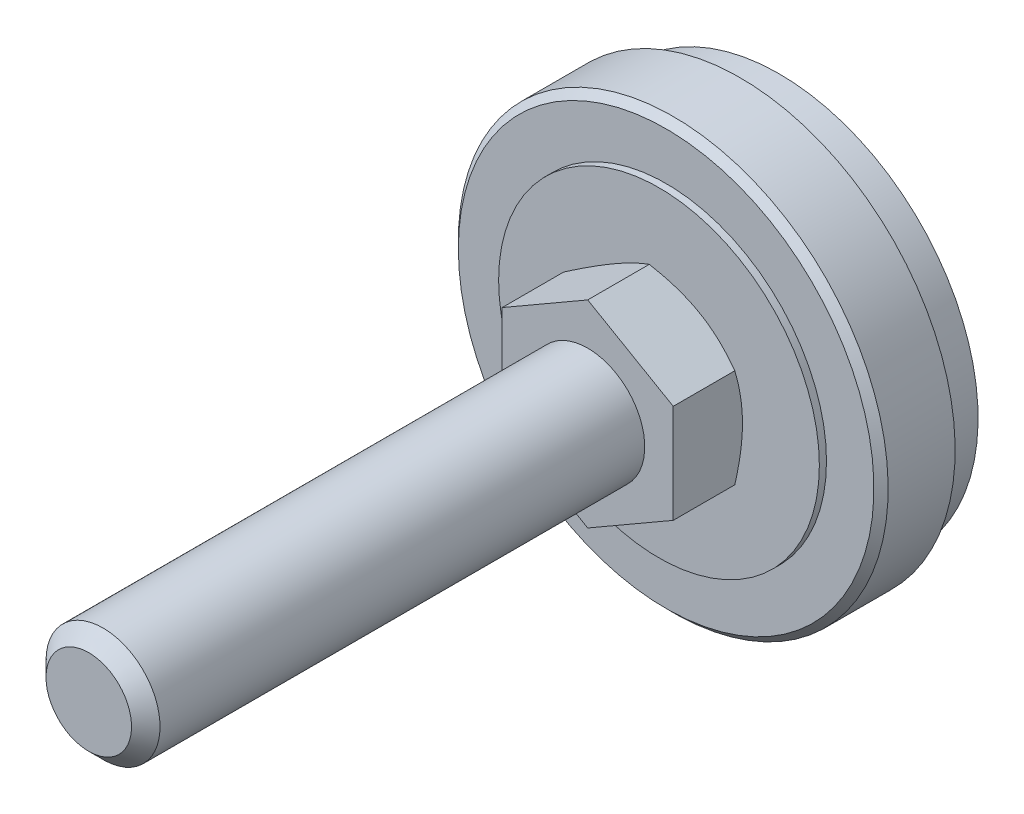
ISO-10303-21;
HEADER;
FILE_DESCRIPTION(('STEP AP214'),'2;1');
FILE_NAME('part.step','',(''),(''),'','','');
FILE_SCHEMA(('AUTOMOTIVE_DESIGN { 1 0 10303 214 1 1 1 1 }'));
ENDSEC;
DATA;
#1=APPLICATION_CONTEXT('core data for automotive mechanical design processes');
#2=APPLICATION_PROTOCOL_DEFINITION('international standard','automotive_design',2000,#1);
#3=PRODUCT_CONTEXT('',#1,'mechanical');
#4=PRODUCT('Part','Part','',(#3));
#5=PRODUCT_RELATED_PRODUCT_CATEGORY('part','',(#4));
#6=PRODUCT_DEFINITION_FORMATION('','',#4);
#7=PRODUCT_DEFINITION_CONTEXT('part definition',#1,'design');
#8=PRODUCT_DEFINITION('design','',#6,#7);
#9=PRODUCT_DEFINITION_SHAPE('','',#8);
#10=(LENGTH_UNIT() NAMED_UNIT(*) SI_UNIT(.MILLI.,.METRE.));
#11=(NAMED_UNIT(*) PLANE_ANGLE_UNIT() SI_UNIT($,.RADIAN.));
#12=(NAMED_UNIT(*) SI_UNIT($,.STERADIAN.) SOLID_ANGLE_UNIT());
#13=UNCERTAINTY_MEASURE_WITH_UNIT(LENGTH_MEASURE(1.E-05),#10,'distance_accuracy_value','');
#14=(GEOMETRIC_REPRESENTATION_CONTEXT(3) GLOBAL_UNCERTAINTY_ASSIGNED_CONTEXT((#13)) GLOBAL_UNIT_ASSIGNED_CONTEXT((#10,
#11,#12)) REPRESENTATION_CONTEXT('',''));
#15=CARTESIAN_POINT('',(0.,0.,0.));
#16=DIRECTION('',(0.,0.,1.));
#17=DIRECTION('',(1.,0.,0.));
#18=AXIS2_PLACEMENT_3D('',#15,#16,#17);
#19=CARTESIAN_POINT('',(0.,0.,26.8670162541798));
#20=DIRECTION('',(0.,0.,1.));
#21=DIRECTION('',(0.5,-0.866025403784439,0.));
#22=AXIS2_PLACEMENT_3D('',#19,#20,#21);
#23=PLANE('',#22);
#24=DIRECTION('',(0.,1.,0.));
#25=VECTOR('',#24,1.);
#26=CARTESIAN_POINT('',(12.,-6.9282032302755,26.8670162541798));
#27=LINE('',#26,#25);
#28=CARTESIAN_POINT('',(12.,-6.9282032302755,26.8670162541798));
#29=VERTEX_POINT('',#28);
#30=CARTESIAN_POINT('',(12.,6.9282032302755,26.8670162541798));
#31=VERTEX_POINT('',#30);
#32=EDGE_CURVE('E227',#29,#31,#27,.T.);
#33=ORIENTED_EDGE('',*,*,#32,.T.);
#34=DIRECTION('',(-0.866025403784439,0.5,0.));
#35=VECTOR('',#34,1.);
#36=CARTESIAN_POINT('',(12.,6.9282032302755,26.8670162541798));
#37=LINE('',#36,#35);
#38=CARTESIAN_POINT('',(0.,13.856406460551,26.8670162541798));
#39=VERTEX_POINT('',#38);
#40=EDGE_CURVE('E374',#31,#39,#37,.T.);
#41=ORIENTED_EDGE('',*,*,#40,.T.);
#42=DIRECTION('',(-0.866025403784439,-0.5,0.));
#43=VECTOR('',#42,1.);
#44=CARTESIAN_POINT('',(0.,13.856406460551,26.8670162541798));
#45=LINE('',#44,#43);
#46=CARTESIAN_POINT('',(-12.,6.92820323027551,26.8670162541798));
#47=VERTEX_POINT('',#46);
#48=EDGE_CURVE('E373',#39,#47,#45,.T.);
#49=ORIENTED_EDGE('',*,*,#48,.T.);
#50=DIRECTION('',(0.,-1.,0.));
#51=VECTOR('',#50,1.);
#52=CARTESIAN_POINT('',(-12.,6.92820323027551,26.8670162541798));
#53=LINE('',#52,#51);
#54=CARTESIAN_POINT('',(-12.,-6.9282032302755,26.8670162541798));
#55=VERTEX_POINT('',#54);
#56=EDGE_CURVE('E378',#47,#55,#53,.T.);
#57=ORIENTED_EDGE('',*,*,#56,.T.);
#58=DIRECTION('',(0.866025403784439,-0.5,0.));
#59=VECTOR('',#58,1.);
#60=CARTESIAN_POINT('',(-12.,-6.9282032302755,26.8670162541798));
#61=LINE('',#60,#59);
#62=CARTESIAN_POINT('',(0.,-13.856406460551,26.8670162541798));
#63=VERTEX_POINT('',#62);
#64=EDGE_CURVE('E380',#55,#63,#61,.T.);
#65=ORIENTED_EDGE('',*,*,#64,.T.);
#66=DIRECTION('',(0.866025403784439,0.5,0.));
#67=VECTOR('',#66,1.);
#68=CARTESIAN_POINT('',(0.,-13.856406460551,26.8670162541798));
#69=LINE('',#68,#67);
#70=EDGE_CURVE('E37',#63,#29,#69,.T.);
#71=ORIENTED_EDGE('',*,*,#70,.T.);
#72=EDGE_LOOP('',(#33,#41,#49,#57,#65,#71));
#73=FACE_BOUND('',#72,.T.);
#74=CARTESIAN_POINT('',(0.,0.,26.8670162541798));
#75=DIRECTION('',(0.,0.,1.));
#76=DIRECTION('',(0.5,-0.866025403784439,0.));
#77=AXIS2_PLACEMENT_3D('',#74,#75,#76);
#78=CIRCLE('',#77,8.);
#79=CARTESIAN_POINT('',(4.,-6.92820323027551,26.8670162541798));
#80=VERTEX_POINT('',#79);
#81=EDGE_CURVE('E231',#80,#80,#78,.T.);
#82=ORIENTED_EDGE('',*,*,#81,.F.);
#83=EDGE_LOOP('',(#82));
#84=FACE_BOUND('',#83,.T.);
#85=ADVANCED_FACE('F14',(#73,#84),#23,.T.);
#86=CARTESIAN_POINT('',(-11.2500000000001,19.4855715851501,16.8670162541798));
#87=DIRECTION('',(0.,0.,-1.));
#88=DIRECTION('',(-0.5,0.866025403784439,0.));
#89=AXIS2_PLACEMENT_3D('',#86,#87,#88);
#90=PLANE('',#89);
#91=CARTESIAN_POINT('',(0.,0.,16.8670162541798));
#92=DIRECTION('',(0.,0.,1.));
#93=DIRECTION('',(0.5,-0.866025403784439,0.));
#94=AXIS2_PLACEMENT_3D('',#91,#92,#93);
#95=CIRCLE('',#94,22.5000000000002);
#96=CARTESIAN_POINT('',(11.2500000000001,-19.4855715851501,16.8670162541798));
#97=VERTEX_POINT('',#96);
#98=EDGE_CURVE('E105',#97,#97,#95,.T.);
#99=ORIENTED_EDGE('',*,*,#98,.T.);
#100=EDGE_LOOP('',(#99));
#101=FACE_BOUND('',#100,.T.);
#102=CARTESIAN_POINT('',(0.,0.,16.8670162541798));
#103=DIRECTION('',(0.,0.,-1.));
#104=DIRECTION('',(-0.5,0.866025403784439,0.));
#105=AXIS2_PLACEMENT_3D('',#102,#103,#104);
#106=CIRCLE('',#105,11.5);
#107=CARTESIAN_POINT('',(-5.75,9.95929214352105,16.8670162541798));
#108=VERTEX_POINT('',#107);
#109=EDGE_CURVE('E84',#108,#108,#106,.T.);
#110=ORIENTED_EDGE('',*,*,#109,.T.);
#111=EDGE_LOOP('',(#110));
#112=FACE_BOUND('',#111,.T.);
#113=ADVANCED_FACE('F190',(#101,#112),#90,.F.);
#114=CARTESIAN_POINT('',(-14.575,25.2446405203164,15.8670162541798));
#115=DIRECTION('',(0.,0.,-1.));
#116=DIRECTION('',(-0.5,0.866025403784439,0.));
#117=AXIS2_PLACEMENT_3D('',#114,#115,#116);
#118=PLANE('',#117);
#119=CARTESIAN_POINT('',(0.,0.,15.8670162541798));
#120=DIRECTION('',(0.,0.,1.));
#121=DIRECTION('',(0.5,-0.866025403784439,0.));
#122=AXIS2_PLACEMENT_3D('',#119,#120,#121);
#123=CIRCLE('',#122,22.5000000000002);
#124=CARTESIAN_POINT('',(11.2500000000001,-19.4855715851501,15.8670162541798));
#125=VERTEX_POINT('',#124);
#126=EDGE_CURVE('E102',#125,#125,#123,.T.);
#127=ORIENTED_EDGE('',*,*,#126,.F.);
#128=EDGE_LOOP('',(#127));
#129=FACE_BOUND('',#128,.T.);
#130=CARTESIAN_POINT('',(0.,0.,15.8670162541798));
#131=DIRECTION('',(0.,0.,1.));
#132=DIRECTION('',(0.5,-0.866025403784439,0.));
#133=AXIS2_PLACEMENT_3D('',#130,#131,#132);
#134=CIRCLE('',#133,29.15);
#135=CARTESIAN_POINT('',(14.575,-25.2446405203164,15.8670162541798));
#136=VERTEX_POINT('',#135);
#137=EDGE_CURVE('E73',#136,#136,#134,.T.);
#138=ORIENTED_EDGE('',*,*,#137,.T.);
#139=EDGE_LOOP('',(#138));
#140=FACE_BOUND('',#139,.T.);
#141=ADVANCED_FACE('F193',(#129,#140),#118,.F.);
#142=CARTESIAN_POINT('',(0.,0.,14.8670162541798));
#143=DIRECTION('',(0.,0.,-1.));
#144=DIRECTION('',(-0.5,0.866025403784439,0.));
#145=AXIS2_PLACEMENT_3D('',#142,#143,#144);
#146=CONICAL_SURFACE('',#145,30.15,0.785398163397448);
#147=ORIENTED_EDGE('',*,*,#137,.F.);
#148=EDGE_LOOP('',(#147));
#149=FACE_BOUND('',#148,.T.);
#150=CARTESIAN_POINT('',(0.,0.,14.8670162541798));
#151=DIRECTION('',(0.,0.,1.));
#152=DIRECTION('',(0.5,-0.866025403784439,0.));
#153=AXIS2_PLACEMENT_3D('',#150,#151,#152);
#154=CIRCLE('',#153,30.15);
#155=CARTESIAN_POINT('',(15.075,-26.1106659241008,14.8670162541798));
#156=VERTEX_POINT('',#155);
#157=EDGE_CURVE('E117',#156,#156,#154,.T.);
#158=ORIENTED_EDGE('',*,*,#157,.T.);
#159=EDGE_LOOP('',(#158));
#160=FACE_BOUND('',#159,.T.);
#161=ADVANCED_FACE('F209',(#149,#160),#146,.T.);
#162=CARTESIAN_POINT('',(0.,0.,104.609314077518));
#163=DIRECTION('',(0.,0.,1.));
#164=DIRECTION('',(0.5,-0.866025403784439,0.));
#165=AXIS2_PLACEMENT_3D('',#162,#163,#164);
#166=CYLINDRICAL_SURFACE('',#165,30.15);
#167=ORIENTED_EDGE('',*,*,#157,.F.);
#168=EDGE_LOOP('',(#167));
#169=FACE_BOUND('',#168,.T.);
#170=CARTESIAN_POINT('',(0.,0.,5.46701625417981));
#171=DIRECTION('',(0.,0.,1.));
#172=DIRECTION('',(0.5,-0.866025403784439,0.));
#173=AXIS2_PLACEMENT_3D('',#170,#171,#172);
#174=CIRCLE('',#173,30.15);
#175=CARTESIAN_POINT('',(15.075,-26.1106659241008,5.46701625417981));
#176=VERTEX_POINT('',#175);
#177=EDGE_CURVE('E114',#176,#176,#174,.T.);
#178=ORIENTED_EDGE('',*,*,#177,.T.);
#179=EDGE_LOOP('',(#178));
#180=FACE_BOUND('',#179,.T.);
#181=ADVANCED_FACE('F205',(#169,#180),#166,.T.);
#182=CARTESIAN_POINT('',(-15.075,26.1106659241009,5.46701625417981));
#183=DIRECTION('',(0.,0.,1.));
#184=DIRECTION('',(0.5,-0.866025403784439,0.));
#185=AXIS2_PLACEMENT_3D('',#182,#183,#184);
#186=PLANE('',#185);
#187=ORIENTED_EDGE('',*,*,#177,.F.);
#188=EDGE_LOOP('',(#187));
#189=FACE_BOUND('',#188,.T.);
#190=CARTESIAN_POINT('',(0.,0.,5.46701625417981));
#191=DIRECTION('',(0.,0.,1.));
#192=DIRECTION('',(0.5,-0.866025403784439,0.));
#193=AXIS2_PLACEMENT_3D('',#190,#191,#192);
#194=CIRCLE('',#193,27.9);
#195=CARTESIAN_POINT('',(13.95,-24.1621087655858,5.46701625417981));
#196=VERTEX_POINT('',#195);
#197=EDGE_CURVE('E111',#196,#196,#194,.T.);
#198=ORIENTED_EDGE('',*,*,#197,.T.);
#199=EDGE_LOOP('',(#198));
#200=FACE_BOUND('',#199,.T.);
#201=ADVANCED_FACE('F201',(#189,#200),#186,.F.);
#202=CARTESIAN_POINT('',(0.,0.,104.609314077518));
#203=DIRECTION('',(0.,0.,1.));
#204=DIRECTION('',(0.5,-0.866025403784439,0.));
#205=AXIS2_PLACEMENT_3D('',#202,#203,#204);
#206=CYLINDRICAL_SURFACE('',#205,27.9);
#207=ORIENTED_EDGE('',*,*,#197,.F.);
#208=EDGE_LOOP('',(#207));
#209=FACE_BOUND('',#208,.T.);
#210=CARTESIAN_POINT('',(0.,0.,0.));
#211=DIRECTION('',(0.,0.,1.));
#212=DIRECTION('',(0.5,-0.866025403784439,0.));
#213=AXIS2_PLACEMENT_3D('',#210,#211,#212);
#214=CIRCLE('',#213,27.9);
#215=CARTESIAN_POINT('',(13.95,-24.1621087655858,0.));
#216=VERTEX_POINT('',#215);
#217=EDGE_CURVE('E108',#216,#216,#214,.T.);
#218=ORIENTED_EDGE('',*,*,#217,.T.);
#219=EDGE_LOOP('',(#218));
#220=FACE_BOUND('',#219,.T.);
#221=ADVANCED_FACE('F197',(#209,#220),#206,.T.);
#222=CARTESIAN_POINT('',(-13.95,24.1621087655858,0.));
#223=DIRECTION('',(0.,0.,1.));
#224=DIRECTION('',(0.5,-0.866025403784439,0.));
#225=AXIS2_PLACEMENT_3D('',#222,#223,#224);
#226=PLANE('',#225);
#227=ORIENTED_EDGE('',*,*,#217,.F.);
#228=EDGE_LOOP('',(#227));
#229=FACE_BOUND('',#228,.T.);
#230=ADVANCED_FACE('F188',(#229),#226,.F.);
#231=CARTESIAN_POINT('',(0.,0.,104.609314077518));
#232=DIRECTION('',(0.,0.,1.));
#233=DIRECTION('',(0.5,-0.866025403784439,0.));
#234=AXIS2_PLACEMENT_3D('',#231,#232,#233);
#235=CYLINDRICAL_SURFACE('',#234,22.5000000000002);
#236=ORIENTED_EDGE('',*,*,#98,.F.);
#237=EDGE_LOOP('',(#236));
#238=FACE_BOUND('',#237,.T.);
#239=ORIENTED_EDGE('',*,*,#126,.T.);
#240=EDGE_LOOP('',(#239));
#241=FACE_BOUND('',#240,.T.);
#242=ADVANCED_FACE('F133',(#238,#241),#235,.T.);
#243=CARTESIAN_POINT('',(0.,0.,20.9823079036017));
#244=DIRECTION('',(0.,0.,1.));
#245=DIRECTION('',(0.5,-0.866025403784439,0.));
#246=AXIS2_PLACEMENT_3D('',#243,#244,#245);
#247=CONICAL_SURFACE('',#246,18.6278942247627,1.0471975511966);
#248=ORIENTED_EDGE('',*,*,#109,.F.);
#249=EDGE_LOOP('',(#248));
#250=FACE_BOUND('',#249,.T.);
#251=CARTESIAN_POINT('',(-10.2110298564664,-19.7517472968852,23.0648899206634));
#252=CARTESIAN_POINT('',(-9.98368629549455,-19.6204904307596,22.9372974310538));
#253=CARTESIAN_POINT('',(-9.75607849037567,-19.4890810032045,22.8103330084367));
#254=CARTESIAN_POINT('',(-9.30027928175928,-19.2259252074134,22.5578023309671));
#255=CARTESIAN_POINT('',(-9.0720878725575,-19.094178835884,22.4322360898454));
#256=CARTESIAN_POINT('',(-8.38649609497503,-18.6983522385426,22.0578152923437));
#257=CARTESIAN_POINT('',(-7.92814398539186,-18.4337225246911,21.8112756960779));
#258=CARTESIAN_POINT('',(-7.00595438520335,-17.9012961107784,21.3245359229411));
#259=CARTESIAN_POINT('',(-6.54210067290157,-17.6334900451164,21.0843766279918));
#260=CARTESIAN_POINT('',(-5.61073723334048,-17.0957671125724,20.613737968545));
#261=CARTESIAN_POINT('',(-5.14322767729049,-16.8258503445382,20.3832581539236));
#262=CARTESIAN_POINT('',(-4.18836683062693,-16.2745611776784,19.9271602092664));
#263=CARTESIAN_POINT('',(-3.70086837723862,-15.9931038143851,19.7019507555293));
#264=CARTESIAN_POINT('',(-2.72019960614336,-15.4269144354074,19.2683134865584));
#265=CARTESIAN_POINT('',(-2.22702866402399,-15.1421820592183,19.0598875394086));
#266=CARTESIAN_POINT('',(-1.23513911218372,-14.5695143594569,18.665212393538));
#267=CARTESIAN_POINT('',(-0.736433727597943,-14.28158667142,18.4789192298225));
#268=CARTESIAN_POINT('',(0.268177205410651,-13.7015742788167,18.1344043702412));
#269=CARTESIAN_POINT('',(0.774080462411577,-13.4094908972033,17.9761739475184));
#270=CARTESIAN_POINT('',(1.53702762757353,-12.9690031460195,17.7659804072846));
#271=CARTESIAN_POINT('',(1.7913124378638,-12.8221917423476,17.7005857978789));
#272=CARTESIAN_POINT('',(2.30163691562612,-12.5275557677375,17.5796160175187));
#273=CARTESIAN_POINT('',(2.55767654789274,-12.3797312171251,17.5240406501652));
#274=CARTESIAN_POINT('',(3.0713408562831,-12.0831669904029,17.4236835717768));
#275=CARTESIAN_POINT('',(3.32896550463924,-11.9344273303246,17.3789016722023));
#276=CARTESIAN_POINT('',(3.8455347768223,-11.6361859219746,17.3010206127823));
#277=CARTESIAN_POINT('',(4.10447934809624,-11.4866842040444,17.2679209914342));
#278=CARTESIAN_POINT('',(4.61990403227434,-11.1891036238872,17.2144832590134));
#279=CARTESIAN_POINT('',(4.87637137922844,-11.0410321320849,17.1939819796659));
#280=CARTESIAN_POINT('',(5.38982690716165,-10.7445884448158,17.1655270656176));
#281=CARTESIAN_POINT('',(5.64681507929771,-10.5962162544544,17.1575732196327));
#282=CARTESIAN_POINT('',(6.16085313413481,-10.2994362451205,17.154402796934));
#283=CARTESIAN_POINT('',(6.41790301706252,-10.1510284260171,17.1591862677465));
#284=CARTESIAN_POINT('',(6.93159691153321,-9.85444711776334,17.1813725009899));
#285=CARTESIAN_POINT('',(7.18824090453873,-9.70627363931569,17.1987758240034));
#286=CARTESIAN_POINT('',(7.80217936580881,-9.35181610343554,17.2551303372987));
#287=CARTESIAN_POINT('',(8.15908147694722,-9.14575857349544,17.2998856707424));
#288=CARTESIAN_POINT('',(8.87030101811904,-8.73513577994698,17.4113904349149));
#289=CARTESIAN_POINT('',(9.2246181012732,-8.53057071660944,17.4781427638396));
#290=CARTESIAN_POINT('',(9.93030705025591,-8.12314101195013,17.6312671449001));
#291=CARTESIAN_POINT('',(10.2816764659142,-7.92027778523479,17.7176541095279));
#292=CARTESIAN_POINT('',(10.980922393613,-7.51656796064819,17.9074058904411));
#293=CARTESIAN_POINT('',(11.3287989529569,-7.31572133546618,18.0107704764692));
#294=CARTESIAN_POINT('',(12.028815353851,-6.91156667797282,18.2344328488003));
#295=CARTESIAN_POINT('',(12.3808761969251,-6.7083042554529,18.355058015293));
#296=CARTESIAN_POINT('',(13.0815308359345,-6.30378111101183,18.6089919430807));
#297=CARTESIAN_POINT('',(13.4301246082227,-6.10252040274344,18.7423007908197));
#298=CARTESIAN_POINT('',(14.1240146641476,-5.70190279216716,19.0194660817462));
#299=CARTESIAN_POINT('',(14.4693119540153,-5.50254530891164,19.1633191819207));
#300=CARTESIAN_POINT('',(15.1570319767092,-5.10548996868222,19.4598589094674));
#301=CARTESIAN_POINT('',(15.4994547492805,-4.9077920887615,19.6125454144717));
#302=CARTESIAN_POINT('',(16.3308610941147,-4.42777941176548,19.993637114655));
#303=CARTESIAN_POINT('',(16.8184925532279,-4.14624525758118,20.2259703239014));
#304=CARTESIAN_POINT('',(17.7894091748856,-3.58568628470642,20.7024817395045));
#305=CARTESIAN_POINT('',(18.2726940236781,-3.30666164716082,20.9466607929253));
#306=CARTESIAN_POINT('',(19.2357659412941,-2.75063181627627,21.4443997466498));
#307=CARTESIAN_POINT('',(19.715552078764,-2.47362716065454,21.6979620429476));
#308=CARTESIAN_POINT('',(20.6721114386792,-1.92135735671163,22.2124987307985));
#309=CARTESIAN_POINT('',(21.1488847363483,-1.64609216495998,22.4734729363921));
#310=CARTESIAN_POINT('',(22.1005140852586,-1.09666870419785,23.0017167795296));
#311=CARTESIAN_POINT('',(22.5753671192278,-0.822512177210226,23.2689936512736));
#312=CARTESIAN_POINT('',(23.5229891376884,-0.275402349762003,23.8084284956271));
#313=CARTESIAN_POINT('',(23.9957581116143,-0.00244905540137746,24.0805864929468));
#314=CARTESIAN_POINT('',(24.9394737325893,0.542405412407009,24.6288789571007));
#315=CARTESIAN_POINT('',(25.4104206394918,0.814306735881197,24.9050128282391));
#316=CARTESIAN_POINT('',(26.3508331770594,1.35725416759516,25.460625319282));
#317=CARTESIAN_POINT('',(26.820298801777,1.62830027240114,25.7401039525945));
#318=CARTESIAN_POINT('',(28.1437583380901,2.39239999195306,26.5329742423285));
#319=CARTESIAN_POINT('',(28.9962940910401,2.88461173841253,27.0496109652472));
#320=CARTESIAN_POINT('',(30.6982431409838,3.86723248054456,28.0897767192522));
#321=CARTESIAN_POINT('',(31.5476563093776,4.35764140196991,28.6133060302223));
#322=CARTESIAN_POINT('',(33.2417498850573,5.33572678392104,29.6641880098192));
#323=CARTESIAN_POINT('',(34.0864368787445,5.82340704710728,30.1915265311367));
#324=CARTESIAN_POINT('',(35.3520063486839,6.554083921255,30.9855660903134));
#325=CARTESIAN_POINT('',(35.7736069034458,6.79749511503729,31.2507433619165));
#326=CARTESIAN_POINT('',(36.6163777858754,7.28406911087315,31.7820062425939));
#327=CARTESIAN_POINT('',(37.0375481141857,7.52723191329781,32.0480918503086));
#328=CARTESIAN_POINT('',(37.4585281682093,7.7702848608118,32.3145783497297));
#329=B_SPLINE_CURVE_WITH_KNOTS('',3,(#251,#252,#253,#254,#255,#256,#257,#258,#259,#260,#261,
#262,#263,#264,#265,#266,#267,#268,#269,#270,#271,#272,#273,#274,#275,#276,#277,#278,#279,#280,
#281,#282,#283,#284,#285,#286,#287,#288,#289,#290,#291,#292,#293,#294,#295,#296,#297,#298,#299,
#300,#301,#302,#303,#304,#305,#306,#307,#308,#309,#310,#311,#312,#313,#314,#315,#316,#317,#318,
#319,#320,#321,#322,#323,#324,#325,#326,#327,#328),.UNSPECIFIED.,.F.,.F.,(4,2,2,2,2,2,2,2,2,2,2,
2,2,2,2,2,2,2,2,2,2,2,2,2,2,2,2,2,2,2,2,2,2,2,2,2,2,2,4),(0.,0.875635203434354,1.75127899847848,
3.50282017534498,5.26371442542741,7.0245266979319,8.84320400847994,10.6620834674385,
12.4772872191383,14.2919254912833,15.1942385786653,16.0965336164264,16.9988128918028,
17.9010565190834,18.791353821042,19.6816361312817,20.5719217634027,21.462246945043,
22.7051761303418,23.9482691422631,25.192309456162,26.436332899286,27.7082164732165,
28.9801087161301,30.2515994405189,31.5230725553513,33.3502380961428,35.1775344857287,
37.0053007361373,38.8330211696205,40.6629527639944,42.4928936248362,44.322563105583,
46.1522399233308,49.4874685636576,52.8228330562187,56.1491881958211,57.812267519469,
59.4753443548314),.UNSPECIFIED.);
#330=CARTESIAN_POINT('',(0.,-13.856406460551,18.2274881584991));
#331=VERTEX_POINT('',#330);
#332=CARTESIAN_POINT('',(12.,-6.9282032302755,18.2274881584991));
#333=VERTEX_POINT('',#332);
#334=EDGE_CURVE('E65',#331,#333,#329,.T.);
#335=ORIENTED_EDGE('',*,*,#334,.F.);
#336=CARTESIAN_POINT('',(-12.0002,-6.92808776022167,18.2275548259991));
#337=CARTESIAN_POINT('',(-11.7364142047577,-7.08038456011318,18.1396410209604));
#338=CARTESIAN_POINT('',(-11.4716448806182,-7.2332492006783,18.0557173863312));
#339=CARTESIAN_POINT('',(-10.9399829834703,-7.54020434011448,17.8969576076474));
#340=CARTESIAN_POINT('',(-10.6730897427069,-7.69429522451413,17.8221244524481));
#341=CARTESIAN_POINT('',(-9.868109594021,-8.15905073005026,17.6127089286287));
#342=CARTESIAN_POINT('',(-9.32684492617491,-8.47155003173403,17.4935946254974));
#343=CARTESIAN_POINT('',(-8.51686717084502,-8.93919090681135,17.3539224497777));
#344=CARTESIAN_POINT('',(-8.25057389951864,-9.09293539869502,17.314135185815));
#345=CARTESIAN_POINT('',(-7.71675440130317,-9.40113622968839,17.2474147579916));
#346=CARTESIAN_POINT('',(-7.44922815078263,-9.55559258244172,17.2204818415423));
#347=CARTESIAN_POINT('',(-6.91372963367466,-9.86476279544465,17.1801599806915));
#348=CARTESIAN_POINT('',(-6.64575827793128,-10.0194761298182,17.1667549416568));
#349=CARTESIAN_POINT('',(-6.10956726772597,-10.3290461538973,17.1537744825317));
#350=CARTESIAN_POINT('',(-5.84134762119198,-10.4839028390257,17.1541986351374));
#351=CARTESIAN_POINT('',(-5.33991062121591,-10.7734076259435,17.1679114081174));
#352=CARTESIAN_POINT('',(-5.10665750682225,-10.908076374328,17.1795273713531));
#353=CARTESIAN_POINT('',(-4.64068775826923,-11.1771041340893,17.2129993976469));
#354=CARTESIAN_POINT('',(-4.40797116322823,-11.3114631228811,17.2348561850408));
#355=CARTESIAN_POINT('',(-3.94320092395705,-11.5797983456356,17.2884288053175));
#356=CARTESIAN_POINT('',(-3.71114798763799,-11.7137741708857,17.3201527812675));
#357=CARTESIAN_POINT('',(-3.24813003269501,-11.9810977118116,17.392903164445));
#358=CARTESIAN_POINT('',(-3.01716508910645,-12.1144453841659,17.4339302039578));
#359=CARTESIAN_POINT('',(-2.31605804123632,-12.5192297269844,17.5720030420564));
#360=CARTESIAN_POINT('',(-1.84794625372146,-12.789494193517,17.6828162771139));
#361=CARTESIAN_POINT('',(-0.918702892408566,-13.3259930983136,17.9343171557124));
#362=CARTESIAN_POINT('',(-0.457559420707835,-13.5922344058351,18.074945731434));
#363=CARTESIAN_POINT('',(0.000199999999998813,-13.8565219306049,18.2275548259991));
#364=B_SPLINE_CURVE_WITH_KNOTS('',3,(#336,#337,#338,#339,#340,#341,#342,#343,#344,#345,#346,
#347,#348,#349,#350,#351,#352,#353,#354,#355,#356,#357,#358,#359,#360,#361,#362,#363),
.UNSPECIFIED.,.F.,.F.,(4,2,2,2,2,2,2,2,2,2,2,2,2,4),(0.,0.951004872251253,1.90232158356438,
3.80900466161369,4.7389455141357,5.66890426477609,6.59775529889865,7.52657763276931,
8.3351464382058,9.14377244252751,9.95306755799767,10.7624176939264,12.4167102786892,
14.0677556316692),.UNSPECIFIED.);
#365=CARTESIAN_POINT('',(-12.,-6.9282032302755,18.2274881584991));
#366=VERTEX_POINT('',#365);
#367=EDGE_CURVE('E68',#366,#331,#364,.T.);
#368=ORIENTED_EDGE('',*,*,#367,.F.);
#369=CARTESIAN_POINT('',(-12.,6.92843417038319,18.2275548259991));
#370=CARTESIAN_POINT('',(-12.,6.62384057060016,18.1396410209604));
#371=CARTESIAN_POINT('',(-12.,6.31811128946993,18.0557173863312));
#372=CARTESIAN_POINT('',(-12.,5.70420101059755,17.8969576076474));
#373=CARTESIAN_POINT('',(-12.,5.39601924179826,17.8221244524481));
#374=CARTESIAN_POINT('',(-12.,4.46650823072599,17.6127089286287));
#375=CARTESIAN_POINT('',(-12.,3.84150962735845,17.4935946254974));
#376=CARTESIAN_POINT('',(-12.,2.9062278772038,17.3539224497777));
#377=CARTESIAN_POINT('',(-12.,2.59873889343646,17.314135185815));
#378=CARTESIAN_POINT('',(-12.,1.98233723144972,17.2474147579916));
#379=CARTESIAN_POINT('',(-12.,1.67342452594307,17.2204818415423));
#380=CARTESIAN_POINT('',(-12.,1.0550840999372,17.1801599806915));
#381=CARTESIAN_POINT('',(-12.,0.745657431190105,17.1667549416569));
#382=CARTESIAN_POINT('',(-12.,0.126517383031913,17.1537744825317));
#383=CARTESIAN_POINT('',(-12.,-0.18319598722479,17.1541986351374));
#384=CARTESIAN_POINT('',(-12.,-0.762205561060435,17.1679114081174));
#385=CARTESIAN_POINT('',(-12.,-1.03154305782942,17.1795273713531));
#386=CARTESIAN_POINT('',(-12.,-1.56959857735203,17.2129993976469));
#387=CARTESIAN_POINT('',(-12.,-1.83831655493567,17.2348561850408));
#388=CARTESIAN_POINT('',(-12.,-2.37498700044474,17.2884288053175));
#389=CARTESIAN_POINT('',(-12.,-2.64293865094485,17.3201527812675));
#390=CARTESIAN_POINT('',(-12.,-3.17758573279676,17.392903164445));
#391=CARTESIAN_POINT('',(-12.,-3.44428107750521,17.4339302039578));
#392=CARTESIAN_POINT('',(-12.,-4.25384976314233,17.5720030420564));
#393=CARTESIAN_POINT('',(-12.,-4.79437869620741,17.6828162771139));
#394=CARTESIAN_POINT('',(-12.,-5.86737650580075,17.9343171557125));
#395=CARTESIAN_POINT('',(-12.,-6.39985912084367,18.074945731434));
#396=CARTESIAN_POINT('',(-12.,-6.92843417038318,18.2275548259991));
#397=B_SPLINE_CURVE_WITH_KNOTS('',3,(#369,#370,#371,#372,#373,#374,#375,#376,#377,#378,#379,
#380,#381,#382,#383,#384,#385,#386,#387,#388,#389,#390,#391,#392,#393,#394,#395,#396),
.UNSPECIFIED.,.F.,.F.,(4,2,2,2,2,2,2,2,2,2,2,2,2,4),(0.,0.951004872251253,1.90232158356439,
3.8090046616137,4.73894551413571,5.66890426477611,6.59775529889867,7.52657763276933,
8.33514643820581,9.14377244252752,9.95306755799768,10.7624176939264,12.4167102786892,
14.0677556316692),.UNSPECIFIED.);
#398=CARTESIAN_POINT('',(-12.,6.92820323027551,18.2274881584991));
#399=VERTEX_POINT('',#398);
#400=EDGE_CURVE('E83',#399,#366,#397,.T.);
#401=ORIENTED_EDGE('',*,*,#400,.F.);
#402=CARTESIAN_POINT('',(-22.2110298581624,1.03286239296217,23.0648899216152));
#403=CARTESIAN_POINT('',(-21.983686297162,1.16411925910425,22.9372974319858));
#404=CARTESIAN_POINT('',(-21.7560784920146,1.29552868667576,22.8103330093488));
#405=CARTESIAN_POINT('',(-21.3002792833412,1.5586844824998,22.5578023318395));
#406=CARTESIAN_POINT('',(-21.0720878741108,1.69043085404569,22.4322360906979));
#407=CARTESIAN_POINT('',(-20.3864960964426,2.08625745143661,22.0578152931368));
#408=CARTESIAN_POINT('',(-19.9281439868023,2.35088716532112,21.8112756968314));
#409=CARTESIAN_POINT('',(-19.0059543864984,2.88331357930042,21.3245359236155));
#410=CARTESIAN_POINT('',(-18.5421006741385,3.15111964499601,21.0843766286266));
#411=CARTESIAN_POINT('',(-17.6107372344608,3.68884257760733,20.6137379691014));
#412=CARTESIAN_POINT('',(-17.1432276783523,3.95875934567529,20.3832581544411));
#413=CARTESIAN_POINT('',(-16.1883668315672,4.51004851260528,19.927160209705));
#414=CARTESIAN_POINT('',(-15.7008683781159,4.79150587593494,19.7019507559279));
#415=CARTESIAN_POINT('',(-14.7201996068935,5.35769525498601,19.2683134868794));
#416=CARTESIAN_POINT('',(-14.2270286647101,5.64242763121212,19.0598875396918));
#417=CARTESIAN_POINT('',(-13.2351391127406,6.21509533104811,18.6652123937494));
#418=CARTESIAN_POINT('',(-12.7364337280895,6.50302301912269,18.4789192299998));
#419=CARTESIAN_POINT('',(-11.7318227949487,7.0830354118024,18.1344043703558));
#420=CARTESIAN_POINT('',(-11.2259195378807,7.37511879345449,17.9761739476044));
#421=CARTESIAN_POINT('',(-10.4629723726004,7.81560654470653,17.7659804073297));
#422=CARTESIAN_POINT('',(-10.2086875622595,7.9624179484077,17.7005857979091));
#423=CARTESIAN_POINT('',(-9.69836308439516,8.25705392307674,17.5796160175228));
#424=CARTESIAN_POINT('',(-9.44232345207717,8.40487847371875,17.5240406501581));
#425=CARTESIAN_POINT('',(-8.9286591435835,8.70144270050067,17.4236835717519));
#426=CARTESIAN_POINT('',(-8.67103449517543,8.85018236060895,17.3789016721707));
#427=CARTESIAN_POINT('',(-8.15446522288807,9.14842376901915,17.3010206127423));
#428=CARTESIAN_POINT('',(-7.89552065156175,9.29792548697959,17.2679209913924));
#429=CARTESIAN_POINT('',(-7.38009596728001,9.59550606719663,17.2144832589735));
#430=CARTESIAN_POINT('',(-7.12362862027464,9.74357755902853,17.1939819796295));
#431=CARTESIAN_POINT('',(-6.610173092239,10.0400212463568,17.1655270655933));
#432=CARTESIAN_POINT('',(-6.35318492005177,10.1883934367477,17.1575732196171));
#433=CARTESIAN_POINT('',(-5.83914686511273,10.4851734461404,17.154402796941));
#434=CARTESIAN_POINT('',(-5.58209698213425,10.6335812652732,17.1591862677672));
#435=CARTESIAN_POINT('',(-5.06840308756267,10.9301625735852,17.181372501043));
#436=CARTESIAN_POINT('',(-4.81175909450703,11.0783360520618,17.1987758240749));
#437=CARTESIAN_POINT('',(-4.19782063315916,11.4327935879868,17.2551303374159));
#438=CARTESIAN_POINT('',(-3.8409185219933,11.6388511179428,17.2998856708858));
#439=CARTESIAN_POINT('',(-3.12969898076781,12.0494739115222,17.4113904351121));
#440=CARTESIAN_POINT('',(-2.77538189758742,12.2540389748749,17.4781427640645));
#441=CARTESIAN_POINT('',(-2.06969294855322,12.6614686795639,17.6312671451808));
#442=CARTESIAN_POINT('',(-1.71832353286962,12.8643319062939,17.7176541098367));
#443=CARTESIAN_POINT('',(-1.01907760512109,13.2680417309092,17.9074058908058));
#444=CARTESIAN_POINT('',(-0.671201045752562,13.4688883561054,18.0107704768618));
#445=CARTESIAN_POINT('',(0.0288153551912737,13.8730430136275,18.2344328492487));
#446=CARTESIAN_POINT('',(0.380876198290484,14.0763054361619,18.3550580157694));
#447=CARTESIAN_POINT('',(1.08153083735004,14.4808285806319,18.6089919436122));
#448=CARTESIAN_POINT('',(1.43012460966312,14.6820892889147,18.7423007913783));
#449=CARTESIAN_POINT('',(2.12401466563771,15.0827068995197,19.0194660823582));
#450=CARTESIAN_POINT('',(2.46931195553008,15.2820643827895,19.1633191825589));
#451=CARTESIAN_POINT('',(3.15703197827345,15.6791197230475,19.459858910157));
#452=CARTESIAN_POINT('',(3.49945475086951,15.8768176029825,19.6125454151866));
#453=CARTESIAN_POINT('',(4.33086109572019,16.356830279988,19.9936371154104));
#454=CARTESIAN_POINT('',(4.81849255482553,16.6383644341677,20.2259703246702));
#455=CARTESIAN_POINT('',(5.78940917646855,17.198923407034,20.7024817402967));
#456=CARTESIAN_POINT('',(6.27269402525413,17.4779480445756,20.9466607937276));
#457=CARTESIAN_POINT('',(7.23576594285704,18.0339778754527,21.4443997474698));
#458=CARTESIAN_POINT('',(7.71555208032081,18.3109825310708,21.6979620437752));
#459=CARTESIAN_POINT('',(8.67211144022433,18.863252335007,22.2124987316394));
#460=CARTESIAN_POINT('',(9.14888473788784,19.1385175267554,22.4734729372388));
#461=CARTESIAN_POINT('',(10.1005140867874,19.6879409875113,23.0017167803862));
#462=CARTESIAN_POINT('',(10.5753671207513,19.9620975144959,23.2689936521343));
#463=CARTESIAN_POINT('',(11.5229891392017,20.5092073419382,23.808428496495));
#464=CARTESIAN_POINT('',(11.9957581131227,20.7821606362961,24.0805864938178));
#465=CARTESIAN_POINT('',(12.9394737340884,21.3270151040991,24.628878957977));
#466=CARTESIAN_POINT('',(13.4104206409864,21.5989164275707,24.9050128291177));
#467=CARTESIAN_POINT('',(14.3508331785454,22.1418638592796,25.4606253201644));
#468=CARTESIAN_POINT('',(14.8202988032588,22.4129099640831,25.7401039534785));
#469=CARTESIAN_POINT('',(16.1437583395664,23.1770096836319,26.5329742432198));
#470=CARTESIAN_POINT('',(16.9962940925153,23.6692214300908,27.0496109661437));
#471=CARTESIAN_POINT('',(18.6982431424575,24.6518421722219,28.089776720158));
#472=CARTESIAN_POINT('',(19.5476563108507,25.1422510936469,28.6133060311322));
#473=CARTESIAN_POINT('',(21.2417498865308,26.1203364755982,29.6641880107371));
#474=CARTESIAN_POINT('',(22.0864368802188,26.608016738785,30.1915265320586));
#475=CARTESIAN_POINT('',(23.3520063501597,27.3386936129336,30.9855660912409));
#476=CARTESIAN_POINT('',(23.7736069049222,27.5821048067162,31.2507433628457));
#477=CARTESIAN_POINT('',(24.6163777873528,28.0686788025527,31.7820062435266));
#478=CARTESIAN_POINT('',(25.0375481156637,28.3118416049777,32.048091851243));
#479=CARTESIAN_POINT('',(25.4585281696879,28.5548945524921,32.3145783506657));
#480=B_SPLINE_CURVE_WITH_KNOTS('',3,(#402,#403,#404,#405,#406,#407,#408,#409,#410,#411,#412,
#413,#414,#415,#416,#417,#418,#419,#420,#421,#422,#423,#424,#425,#426,#427,#428,#429,#430,#431,
#432,#433,#434,#435,#436,#437,#438,#439,#440,#441,#442,#443,#444,#445,#446,#447,#448,#449,#450,
#451,#452,#453,#454,#455,#456,#457,#458,#459,#460,#461,#462,#463,#464,#465,#466,#467,#468,#469,
#470,#471,#472,#473,#474,#475,#476,#477,#478,#479),.UNSPECIFIED.,.F.,.F.,(4,2,2,2,2,2,2,2,2,2,2,
2,2,2,2,2,2,2,2,2,2,2,2,2,2,2,2,2,2,2,2,2,2,2,2,2,2,2,4),(0.,0.875635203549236,1.75127899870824,
3.50282017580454,5.26371442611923,7.02452669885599,8.84320400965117,10.662083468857,
12.4772872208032,14.2919254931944,15.1942385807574,16.0965336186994,16.9988128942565,
17.9010565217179,18.7913538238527,19.6816361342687,20.5719217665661,21.4622469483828,
22.7051761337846,23.948269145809,25.1923094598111,26.4363329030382,27.7082164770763,
28.9801087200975,30.2515994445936,31.5230725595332,33.3502381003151,35.1775344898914,
37.00530074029,38.8330211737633,40.6629527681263,42.4928936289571,44.3225631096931,
46.1522399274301,49.4874685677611,52.8228330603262,56.1491881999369,57.812267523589,
59.4753443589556),.UNSPECIFIED.);
#481=CARTESIAN_POINT('',(0.,13.856406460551,18.2274881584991));
#482=VERTEX_POINT('',#481);
#483=EDGE_CURVE('E155',#482,#399,#480,.F.);
#484=ORIENTED_EDGE('',*,*,#483,.F.);
#485=CARTESIAN_POINT('',(12.0002,6.92808776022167,18.2275548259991));
#486=CARTESIAN_POINT('',(11.7364142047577,7.08038456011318,18.1396410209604));
#487=CARTESIAN_POINT('',(11.4716448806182,7.2332492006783,18.0557173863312));
#488=CARTESIAN_POINT('',(10.9399829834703,7.54020434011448,17.8969576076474));
#489=CARTESIAN_POINT('',(10.6730897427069,7.69429522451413,17.8221244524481));
#490=CARTESIAN_POINT('',(9.868109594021,8.15905073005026,17.6127089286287));
#491=CARTESIAN_POINT('',(9.32684492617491,8.47155003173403,17.4935946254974));
#492=CARTESIAN_POINT('',(8.51686717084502,8.93919090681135,17.3539224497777));
#493=CARTESIAN_POINT('',(8.25057389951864,9.09293539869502,17.314135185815));
#494=CARTESIAN_POINT('',(7.71675440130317,9.40113622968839,17.2474147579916));
#495=CARTESIAN_POINT('',(7.44922815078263,9.55559258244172,17.2204818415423));
#496=CARTESIAN_POINT('',(6.91372963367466,9.86476279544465,17.1801599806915));
#497=CARTESIAN_POINT('',(6.64575827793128,10.0194761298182,17.1667549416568));
#498=CARTESIAN_POINT('',(6.10956726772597,10.3290461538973,17.1537744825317));
#499=CARTESIAN_POINT('',(5.84134762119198,10.4839028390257,17.1541986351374));
#500=CARTESIAN_POINT('',(5.33991062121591,10.7734076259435,17.1679114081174));
#501=CARTESIAN_POINT('',(5.10665750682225,10.908076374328,17.1795273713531));
#502=CARTESIAN_POINT('',(4.64068775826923,11.1771041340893,17.2129993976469));
#503=CARTESIAN_POINT('',(4.40797116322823,11.3114631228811,17.2348561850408));
#504=CARTESIAN_POINT('',(3.94320092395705,11.5797983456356,17.2884288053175));
#505=CARTESIAN_POINT('',(3.711147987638,11.7137741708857,17.3201527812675));
#506=CARTESIAN_POINT('',(3.24813003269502,11.9810977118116,17.392903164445));
#507=CARTESIAN_POINT('',(3.01716508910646,12.1144453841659,17.4339302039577));
#508=CARTESIAN_POINT('',(2.31605804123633,12.5192297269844,17.5720030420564));
#509=CARTESIAN_POINT('',(1.84794625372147,12.789494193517,17.6828162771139));
#510=CARTESIAN_POINT('',(0.918702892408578,13.3259930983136,17.9343171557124));
#511=CARTESIAN_POINT('',(0.457559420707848,13.5922344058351,18.074945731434));
#512=CARTESIAN_POINT('',(-0.000199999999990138,13.8565219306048,18.2275548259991));
#513=B_SPLINE_CURVE_WITH_KNOTS('',3,(#485,#486,#487,#488,#489,#490,#491,#492,#493,#494,#495,
#496,#497,#498,#499,#500,#501,#502,#503,#504,#505,#506,#507,#508,#509,#510,#511,#512),
.UNSPECIFIED.,.F.,.F.,(4,2,2,2,2,2,2,2,2,2,2,2,2,4),(0.,0.951004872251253,1.90232158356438,
3.80900466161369,4.7389455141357,5.66890426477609,6.59775529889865,7.52657763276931,
8.3351464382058,9.14377244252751,9.95306755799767,10.7624176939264,12.4167102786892,
14.0677556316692),.UNSPECIFIED.);
#514=CARTESIAN_POINT('',(12.,6.9282032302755,18.2274881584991));
#515=VERTEX_POINT('',#514);
#516=EDGE_CURVE('E162',#515,#482,#513,.T.);
#517=ORIENTED_EDGE('',*,*,#516,.F.);
#518=CARTESIAN_POINT('',(12.,-6.92843417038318,18.2275548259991));
#519=CARTESIAN_POINT('',(12.,-6.62384057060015,18.1396410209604));
#520=CARTESIAN_POINT('',(12.,-6.31811128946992,18.0557173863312));
#521=CARTESIAN_POINT('',(12.,-5.70420101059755,17.8969576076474));
#522=CARTESIAN_POINT('',(12.,-5.39601924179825,17.8221244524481));
#523=CARTESIAN_POINT('',(12.,-4.46650823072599,17.6127089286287));
#524=CARTESIAN_POINT('',(12.,-3.84150962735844,17.4935946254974));
#525=CARTESIAN_POINT('',(12.,-2.90622787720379,17.3539224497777));
#526=CARTESIAN_POINT('',(12.,-2.59873889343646,17.314135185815));
#527=CARTESIAN_POINT('',(12.,-1.98233723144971,17.2474147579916));
#528=CARTESIAN_POINT('',(12.,-1.67342452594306,17.2204818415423));
#529=CARTESIAN_POINT('',(12.,-1.0550840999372,17.1801599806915));
#530=CARTESIAN_POINT('',(12.,-0.745657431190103,17.1667549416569));
#531=CARTESIAN_POINT('',(12.,-0.126517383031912,17.1537744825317));
#532=CARTESIAN_POINT('',(12.,0.183195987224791,17.1541986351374));
#533=CARTESIAN_POINT('',(12.,0.762205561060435,17.1679114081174));
#534=CARTESIAN_POINT('',(12.,1.03154305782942,17.1795273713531));
#535=CARTESIAN_POINT('',(12.,1.56959857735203,17.2129993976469));
#536=CARTESIAN_POINT('',(12.,1.83831655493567,17.2348561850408));
#537=CARTESIAN_POINT('',(12.,2.37498700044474,17.2884288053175));
#538=CARTESIAN_POINT('',(12.,2.64293865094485,17.3201527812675));
#539=CARTESIAN_POINT('',(12.,3.17758573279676,17.392903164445));
#540=CARTESIAN_POINT('',(12.,3.44428107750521,17.4339302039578));
#541=CARTESIAN_POINT('',(12.,4.25384976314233,17.5720030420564));
#542=CARTESIAN_POINT('',(12.,4.79437869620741,17.6828162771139));
#543=CARTESIAN_POINT('',(12.,5.86737650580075,17.9343171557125));
#544=CARTESIAN_POINT('',(12.,6.39985912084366,18.074945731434));
#545=CARTESIAN_POINT('',(12.,6.92843417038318,18.2275548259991));
#546=B_SPLINE_CURVE_WITH_KNOTS('',3,(#518,#519,#520,#521,#522,#523,#524,#525,#526,#527,#528,
#529,#530,#531,#532,#533,#534,#535,#536,#537,#538,#539,#540,#541,#542,#543,#544,#545),
.UNSPECIFIED.,.F.,.F.,(4,2,2,2,2,2,2,2,2,2,2,2,2,4),(0.,0.951004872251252,1.90232158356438,
3.80900466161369,4.73894551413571,5.6689042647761,6.59775529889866,7.52657763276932,
8.3351464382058,9.14377244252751,9.95306755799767,10.7624176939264,12.4167102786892,
14.0677556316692),.UNSPECIFIED.);
#547=EDGE_CURVE('E29',#333,#515,#546,.T.);
#548=ORIENTED_EDGE('',*,*,#547,.F.);
#549=EDGE_LOOP('',(#335,#368,#401,#484,#517,#548));
#550=FACE_BOUND('',#549,.T.);
#551=ADVANCED_FACE('F67',(#250,#550),#247,.T.);
#552=CARTESIAN_POINT('',(0.,-13.856406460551,26.8670162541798));
#553=DIRECTION('',(-0.5,0.866025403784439,0.));
#554=DIRECTION('',(0.,0.,1.));
#555=AXIS2_PLACEMENT_3D('',#552,#553,#554);
#556=PLANE('',#555);
#557=DIRECTION('',(0.,0.,-1.));
#558=VECTOR('',#557,1.);
#559=CARTESIAN_POINT('',(0.,-13.856406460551,26.8670162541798));
#560=LINE('',#559,#558);
#561=EDGE_CURVE('E80',#63,#331,#560,.T.);
#562=ORIENTED_EDGE('',*,*,#561,.T.);
#563=ORIENTED_EDGE('',*,*,#334,.T.);
#564=DIRECTION('',(0.,0.,-1.));
#565=VECTOR('',#564,1.);
#566=CARTESIAN_POINT('',(12.,-6.9282032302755,26.8670162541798));
#567=LINE('',#566,#565);
#568=EDGE_CURVE('E87',#29,#333,#567,.T.);
#569=ORIENTED_EDGE('',*,*,#568,.F.);
#570=ORIENTED_EDGE('',*,*,#70,.F.);
#571=EDGE_LOOP('',(#562,#563,#569,#570));
#572=FACE_BOUND('',#571,.T.);
#573=ADVANCED_FACE('F86',(#572),#556,.F.);
#574=CARTESIAN_POINT('',(-12.,-6.9282032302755,26.8670162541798));
#575=DIRECTION('',(0.5,0.866025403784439,0.));
#576=DIRECTION('',(-0.866025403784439,0.5,0.));
#577=AXIS2_PLACEMENT_3D('',#574,#575,#576);
#578=PLANE('',#577);
#579=DIRECTION('',(0.,0.,-1.));
#580=VECTOR('',#579,1.);
#581=CARTESIAN_POINT('',(-12.,-6.9282032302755,26.8670162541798));
#582=LINE('',#581,#580);
#583=EDGE_CURVE('E82',#55,#366,#582,.T.);
#584=ORIENTED_EDGE('',*,*,#583,.T.);
#585=ORIENTED_EDGE('',*,*,#367,.T.);
#586=ORIENTED_EDGE('',*,*,#561,.F.);
#587=ORIENTED_EDGE('',*,*,#64,.F.);
#588=EDGE_LOOP('',(#584,#585,#586,#587));
#589=FACE_BOUND('',#588,.T.);
#590=ADVANCED_FACE('F78',(#589),#578,.F.);
#591=CARTESIAN_POINT('',(-12.,6.92820323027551,26.8670162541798));
#592=DIRECTION('',(1.,0.,0.));
#593=DIRECTION('',(0.,1.,0.));
#594=AXIS2_PLACEMENT_3D('',#591,#592,#593);
#595=PLANE('',#594);
#596=DIRECTION('',(0.,0.,-1.));
#597=VECTOR('',#596,1.);
#598=CARTESIAN_POINT('',(-12.,6.92820323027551,26.8670162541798));
#599=LINE('',#598,#597);
#600=EDGE_CURVE('E89',#47,#399,#599,.T.);
#601=ORIENTED_EDGE('',*,*,#600,.T.);
#602=ORIENTED_EDGE('',*,*,#400,.T.);
#603=ORIENTED_EDGE('',*,*,#583,.F.);
#604=ORIENTED_EDGE('',*,*,#56,.F.);
#605=EDGE_LOOP('',(#601,#602,#603,#604));
#606=FACE_BOUND('',#605,.T.);
#607=ADVANCED_FACE('F351',(#606),#595,.F.);
#608=CARTESIAN_POINT('',(0.,13.856406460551,26.8670162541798));
#609=DIRECTION('',(0.5,-0.866025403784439,0.));
#610=DIRECTION('',(0.866025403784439,0.5,0.));
#611=AXIS2_PLACEMENT_3D('',#608,#609,#610);
#612=PLANE('',#611);
#613=DIRECTION('',(0.,0.,-1.));
#614=VECTOR('',#613,1.);
#615=CARTESIAN_POINT('',(0.,13.856406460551,26.8670162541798));
#616=LINE('',#615,#614);
#617=EDGE_CURVE('E96',#39,#482,#616,.T.);
#618=ORIENTED_EDGE('',*,*,#617,.T.);
#619=ORIENTED_EDGE('',*,*,#483,.T.);
#620=ORIENTED_EDGE('',*,*,#600,.F.);
#621=ORIENTED_EDGE('',*,*,#48,.F.);
#622=EDGE_LOOP('',(#618,#619,#620,#621));
#623=FACE_BOUND('',#622,.T.);
#624=ADVANCED_FACE('F179',(#623),#612,.F.);
#625=CARTESIAN_POINT('',(12.,6.9282032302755,26.8670162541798));
#626=DIRECTION('',(-0.5,-0.866025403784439,0.));
#627=DIRECTION('',(0.866025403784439,-0.5,0.));
#628=AXIS2_PLACEMENT_3D('',#625,#626,#627);
#629=PLANE('',#628);
#630=DIRECTION('',(0.,0.,-1.));
#631=VECTOR('',#630,1.);
#632=CARTESIAN_POINT('',(12.,6.9282032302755,26.8670162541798));
#633=LINE('',#632,#631);
#634=EDGE_CURVE('E99',#31,#515,#633,.T.);
#635=ORIENTED_EDGE('',*,*,#634,.T.);
#636=ORIENTED_EDGE('',*,*,#516,.T.);
#637=ORIENTED_EDGE('',*,*,#617,.F.);
#638=ORIENTED_EDGE('',*,*,#40,.F.);
#639=EDGE_LOOP('',(#635,#636,#637,#638));
#640=FACE_BOUND('',#639,.T.);
#641=ADVANCED_FACE('F175',(#640),#629,.F.);
#642=CARTESIAN_POINT('',(12.,-6.9282032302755,26.8670162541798));
#643=DIRECTION('',(-1.,0.,0.));
#644=DIRECTION('',(0.,-1.,0.));
#645=AXIS2_PLACEMENT_3D('',#642,#643,#644);
#646=PLANE('',#645);
#647=ORIENTED_EDGE('',*,*,#568,.T.);
#648=ORIENTED_EDGE('',*,*,#547,.T.);
#649=ORIENTED_EDGE('',*,*,#634,.F.);
#650=ORIENTED_EDGE('',*,*,#32,.F.);
#651=EDGE_LOOP('',(#647,#648,#649,#650));
#652=FACE_BOUND('',#651,.T.);
#653=ADVANCED_FACE('F178',(#652),#646,.F.);
#654=CARTESIAN_POINT('',(0.,0.,96.8670162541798));
#655=DIRECTION('',(0.,0.,-1.));
#656=DIRECTION('',(-0.5,0.866025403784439,0.));
#657=AXIS2_PLACEMENT_3D('',#654,#655,#656);
#658=CYLINDRICAL_SURFACE('',#657,8.);
#659=CARTESIAN_POINT('',(0.,0.,94.8670162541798));
#660=DIRECTION('',(0.,0.,1.));
#661=DIRECTION('',(0.5,-0.866025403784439,0.));
#662=AXIS2_PLACEMENT_3D('',#659,#660,#661);
#663=CIRCLE('',#662,8.);
#664=CARTESIAN_POINT('',(4.,-6.92820323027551,94.8670162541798));
#665=VERTEX_POINT('',#664);
#666=EDGE_CURVE('E9',#665,#665,#663,.F.);
#667=ORIENTED_EDGE('',*,*,#666,.T.);
#668=EDGE_LOOP('',(#667));
#669=FACE_BOUND('',#668,.T.);
#670=ORIENTED_EDGE('',*,*,#81,.T.);
#671=EDGE_LOOP('',(#670));
#672=FACE_BOUND('',#671,.T.);
#673=ADVANCED_FACE('F135',(#669,#672),#658,.T.);
#674=CARTESIAN_POINT('',(0.,0.,96.8670162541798));
#675=DIRECTION('',(0.,0.,1.));
#676=DIRECTION('',(0.5,-0.866025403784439,0.));
#677=AXIS2_PLACEMENT_3D('',#674,#675,#676);
#678=PLANE('',#677);
#679=CARTESIAN_POINT('',(0.,0.,96.8670162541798));
#680=DIRECTION('',(0.,0.,1.));
#681=DIRECTION('',(0.5,-0.866025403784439,0.));
#682=AXIS2_PLACEMENT_3D('',#679,#680,#681);
#683=CIRCLE('',#682,6.);
#684=CARTESIAN_POINT('',(3.,-5.19615242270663,96.8670162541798));
#685=VERTEX_POINT('',#684);
#686=EDGE_CURVE('E22',#685,#685,#683,.T.);
#687=ORIENTED_EDGE('',*,*,#686,.T.);
#688=EDGE_LOOP('',(#687));
#689=FACE_BOUND('',#688,.T.);
#690=ADVANCED_FACE('F238',(#689),#678,.T.);
#691=CARTESIAN_POINT('',(0.,0.,96.8670162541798));
#692=DIRECTION('',(0.,0.,-1.));
#693=DIRECTION('',(-0.5,0.866025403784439,0.));
#694=AXIS2_PLACEMENT_3D('',#691,#692,#693);
#695=CONICAL_SURFACE('',#694,6.,0.785398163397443);
#696=ORIENTED_EDGE('',*,*,#666,.F.);
#697=EDGE_LOOP('',(#696));
#698=FACE_BOUND('',#697,.T.);
#699=ORIENTED_EDGE('',*,*,#686,.F.);
#700=EDGE_LOOP('',(#699));
#701=FACE_BOUND('',#700,.T.);
#702=ADVANCED_FACE('F16',(#698,#701),#695,.T.);
#703=CLOSED_SHELL('',(#85,#113,#141,#161,#181,#201,#221,#230,#242,#551,#573,#590,#607,#624,#641,
#653,#673,#690,#702));
#704=MANIFOLD_SOLID_BREP('B1',#703);
#705=ADVANCED_BREP_SHAPE_REPRESENTATION('',(#18,#704),#14);
#706=SHAPE_DEFINITION_REPRESENTATION(#9,#705);
ENDSEC;
END-ISO-10303-21;
